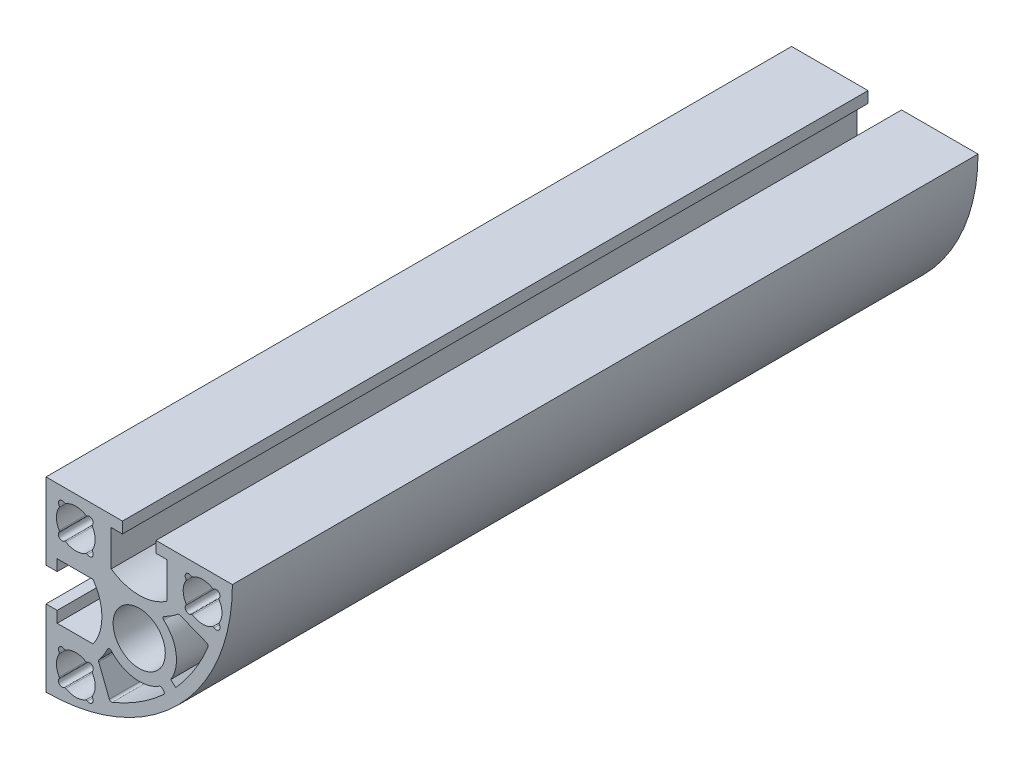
from build123d import *

# Parameters (mm, degrees)
SKETCH_1_R      = 3.5
EXTRUDE_1_DEPTH = 50


with BuildPart() as part:
    # Sketch 1 → Extrude 1 (new, symmetric)
    with BuildSketch(Plane.XY):
        with BuildLine():
            Line((-11, 3.75), (-6.190809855, 3.75))
            ThreePointArc((-6.190809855, 3.75), (-5, 0), (-6.190809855, -3.75))
            Line((-6.190809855, -3.75), (-11, -3.75))
            Line((-11, -3.75), (-11, -2.25))
            Line((-11, -2.25), (-12.5, -2.25))
            Line((-12.5, -2.25), (-12.5, -12.5))
            ThreePointArc((-12.5, -12.5), (5.17766953, -5.17766953), (12.5, 12.5))
            Line((12.5, 12.5), (2.25, 12.5))
            Line((2.25, 12.5), (2.25, 11))
            Line((2.25, 11), (3.75, 11))
            Line((3.75, 11), (3.75, 6.190809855))
            ThreePointArc((3.75, 6.190809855), (0, 5), (-3.75, 6.190809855))
            Line((-3.75, 6.190809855), (-3.75, 11))
            Line((-3.75, 11), (-2.25, 11))
            Line((-2.25, 11), (-2.25, 12.5))
            Line((-2.25, 12.5), (-12.5, 12.5))
            Line((-12.5, 12.5), (-12.5, 2.25))
            Line((-12.5, 2.25), (-11, 2.25))
            Line((-11, 2.25), (-11, 3.75))
        make_face()
        Circle(SKETCH_1_R, mode=Mode.SUBTRACT)
        with BuildLine():
            Line((-5.427959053, -5.453421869), (-4.003466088, -9.069707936))
            ThreePointArc((-4.003466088, -9.069707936), (-3.842149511, -9.235658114), (-3.6107204, -9.237409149))
            ThreePointArc((-3.6107204, -9.237409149), (0.019297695, -7.368728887), (3.271104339, -4.899973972))
            ThreePointArc((3.271104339, -4.899973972), (3.369358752, -4.690468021), (3.289286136, -4.473361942))
            Line((3.289286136, -4.473361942), (3.085342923, -4.254124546))
            ThreePointArc((3.085342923, -4.254124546), (2.903128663, -4.160802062), (2.703478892, -4.206091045))
            ThreePointArc((2.703478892, -4.206091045), (-0.690556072, -4.952083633), (-3.751025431, -3.306026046))
            ThreePointArc((-3.751025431, -3.306026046), (-4.018920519, -3.207461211), (-4.248035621, -3.377722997))
            ThreePointArc((-4.248035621, -3.377722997), (-4.754732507, -4.301321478), (-5.378394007, -5.150333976))
            ThreePointArc((-5.378394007, -5.150333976), (-5.444901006, -5.29505457), (-5.427959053, -5.453421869))
        make_face(mode=Mode.SUBTRACT)
        with BuildLine():
            Line((4.230797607, -2.664648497), (4.899973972, -3.271104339))
            ThreePointArc((4.899973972, -3.271104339), (7.368728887, -0.019297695), (9.237409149, 3.6107204))
            ThreePointArc((9.237409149, 3.6107204), (9.235658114, 3.842149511), (9.069707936, 4.003466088))
            Line((9.069707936, 4.003466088), (5.453421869, 5.427959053))
            ThreePointArc((5.453421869, 5.427959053), (5.29505457, 5.444901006), (5.150333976, 5.378394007))
            ThreePointArc((5.150333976, 5.378394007), (4.301321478, 4.754732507), (3.377722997, 4.248035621))
            ThreePointArc((3.377722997, 4.248035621), (3.207461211, 4.018920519), (3.306026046, 3.751025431))
            ThreePointArc((3.306026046, 3.751025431), (4.948852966, 0.713340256), (4.230797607, -2.664648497))
        make_face(mode=Mode.SUBTRACT)
        with BuildLine():
            ThreePointArc((-10.735198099, 9.828115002), (-11.1, 8.5), (-10.735198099, 7.171884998))
            ThreePointArc((-10.735198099, 7.171884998), (-10.707323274, 7.061078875), (-10.744662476, 6.953093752))
            ThreePointArc((-10.744662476, 6.953093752), (-10.692031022, 6.307968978), (-10.046906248, 6.255337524))
            ThreePointArc((-10.046906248, 6.255337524), (-9.938921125, 6.292676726), (-9.828115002, 6.264801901))
            ThreePointArc((-9.828115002, 6.264801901), (-8.5, 5.9), (-7.171884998, 6.264801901))
            ThreePointArc((-7.171884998, 6.264801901), (-7.061078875, 6.292676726), (-6.953093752, 6.255337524))
            ThreePointArc((-6.953093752, 6.255337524), (-6.307968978, 6.307968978), (-6.255337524, 6.953093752))
            ThreePointArc((-6.255337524, 6.953093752), (-6.292676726, 7.061078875), (-6.264801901, 7.171884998))
            ThreePointArc((-6.264801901, 7.171884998), (-5.9, 8.5), (-6.264801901, 9.828115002))
            ThreePointArc((-6.264801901, 9.828115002), (-6.292676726, 9.938921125), (-6.255337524, 10.046906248))
            ThreePointArc((-6.255337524, 10.046906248), (-6.307968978, 10.692031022), (-6.953093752, 10.744662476))
            ThreePointArc((-6.953093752, 10.744662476), (-7.061078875, 10.707323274), (-7.171884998, 10.735198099))
            ThreePointArc((-7.171884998, 10.735198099), (-8.5, 11.1), (-9.828115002, 10.735198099))
            ThreePointArc((-9.828115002, 10.735198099), (-9.938921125, 10.707323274), (-10.046906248, 10.744662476))
            ThreePointArc((-10.046906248, 10.744662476), (-10.692031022, 10.692031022), (-10.744662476, 10.046906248))
            ThreePointArc((-10.744662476, 10.046906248), (-10.707323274, 9.938921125), (-10.735198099, 9.828115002))
        make_face(mode=Mode.SUBTRACT)
        with BuildLine():
            ThreePointArc((10.744662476, 10.046906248), (10.707323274, 9.938921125), (10.735198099, 9.828115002))
            ThreePointArc((10.735198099, 9.828115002), (11.1, 8.5), (10.735198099, 7.171884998))
            ThreePointArc((10.735198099, 7.171884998), (10.707323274, 7.061078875), (10.744662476, 6.953093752))
            ThreePointArc((10.744662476, 6.953093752), (10.692031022, 6.307968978), (10.046906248, 6.255337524))
            ThreePointArc((10.046906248, 6.255337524), (9.938921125, 6.292676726), (9.828115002, 6.264801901))
            ThreePointArc((9.828115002, 6.264801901), (8.5, 5.9), (7.171884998, 6.264801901))
            ThreePointArc((7.171884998, 6.264801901), (7.061078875, 6.292676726), (6.953093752, 6.255337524))
            ThreePointArc((6.953093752, 6.255337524), (6.307968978, 6.307968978), (6.255337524, 6.953093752))
            ThreePointArc((6.255337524, 6.953093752), (6.292676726, 7.061078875), (6.264801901, 7.171884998))
            ThreePointArc((6.264801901, 7.171884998), (5.9, 8.5), (6.264801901, 9.828115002))
            ThreePointArc((6.264801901, 9.828115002), (6.292676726, 9.938921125), (6.255337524, 10.046906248))
            ThreePointArc((6.255337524, 10.046906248), (6.307968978, 10.692031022), (6.953093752, 10.744662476))
            ThreePointArc((6.953093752, 10.744662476), (7.061078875, 10.707323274), (7.171884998, 10.735198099))
            ThreePointArc((7.171884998, 10.735198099), (8.5, 11.1), (9.828115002, 10.735198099))
            ThreePointArc((9.828115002, 10.735198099), (9.938921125, 10.707323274), (10.046906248, 10.744662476))
            ThreePointArc((10.046906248, 10.744662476), (10.692031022, 10.692031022), (10.744662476, 10.046906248))
        make_face(mode=Mode.SUBTRACT)
        with BuildLine():
            ThreePointArc((-10.744662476, -10.046906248), (-10.707323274, -9.938921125), (-10.735198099, -9.828115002))
            ThreePointArc((-10.735198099, -9.828115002), (-11.1, -8.5), (-10.735198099, -7.171884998))
            ThreePointArc((-10.735198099, -7.171884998), (-10.707323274, -7.061078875), (-10.744662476, -6.953093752))
            ThreePointArc((-10.744662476, -6.953093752), (-10.692031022, -6.307968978), (-10.046906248, -6.255337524))
            ThreePointArc((-10.046906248, -6.255337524), (-9.938921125, -6.292676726), (-9.828115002, -6.264801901))
            ThreePointArc((-9.828115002, -6.264801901), (-8.5, -5.9), (-7.171884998, -6.264801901))
            ThreePointArc((-7.171884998, -6.264801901), (-7.061078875, -6.292676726), (-6.953093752, -6.255337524))
            ThreePointArc((-6.953093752, -6.255337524), (-6.307968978, -6.307968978), (-6.255337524, -6.953093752))
            ThreePointArc((-6.255337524, -6.953093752), (-6.292676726, -7.061078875), (-6.264801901, -7.171884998))
            ThreePointArc((-6.264801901, -7.171884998), (-5.9, -8.5), (-6.264801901, -9.828115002))
            ThreePointArc((-6.264801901, -9.828115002), (-6.292676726, -9.938921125), (-6.255337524, -10.046906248))
            ThreePointArc((-6.255337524, -10.046906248), (-6.307968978, -10.692031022), (-6.953093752, -10.744662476))
            ThreePointArc((-6.953093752, -10.744662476), (-7.061078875, -10.707323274), (-7.171884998, -10.735198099))
            ThreePointArc((-7.171884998, -10.735198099), (-8.5, -11.1), (-9.828115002, -10.735198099))
            ThreePointArc((-9.828115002, -10.735198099), (-9.938921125, -10.707323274), (-10.046906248, -10.744662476))
            ThreePointArc((-10.046906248, -10.744662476), (-10.692031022, -10.692031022), (-10.744662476, -10.046906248))
        make_face(mode=Mode.SUBTRACT)
    extrude(amount=EXTRUDE_1_DEPTH, both=True)


solid = part.part
